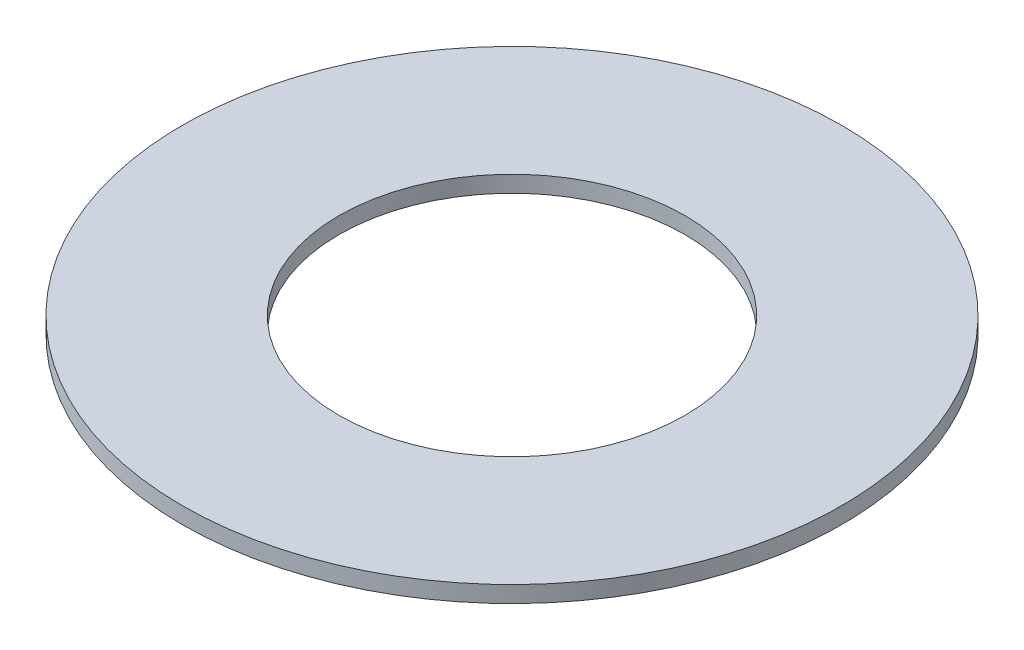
from build123d import *

# Parameters (mm, degrees)
SZKIC1_R                    = 10
SZKIC1_R_2                  = 5.25
DODANIE_WYCI_GNI_CIE1_DEPTH = 0.5


with BuildPart() as part:
    # Szkic1 → Dodanie-wyci_gni_cie1 (new body)
    with BuildSketch(Plane(origin=(0, 0, 0), x_dir=(1, 0, 0), z_dir=(0, 1, 0))):
        with Locations(Location((0, 0, 0), (0, 0, 270))):
            Circle(SZKIC1_R)
        with Locations(Location((0, 0, 0), (0, 0, 270))):
            Circle(SZKIC1_R_2, mode=Mode.SUBTRACT)
    extrude(amount=DODANIE_WYCI_GNI_CIE1_DEPTH)


solid = part.part
